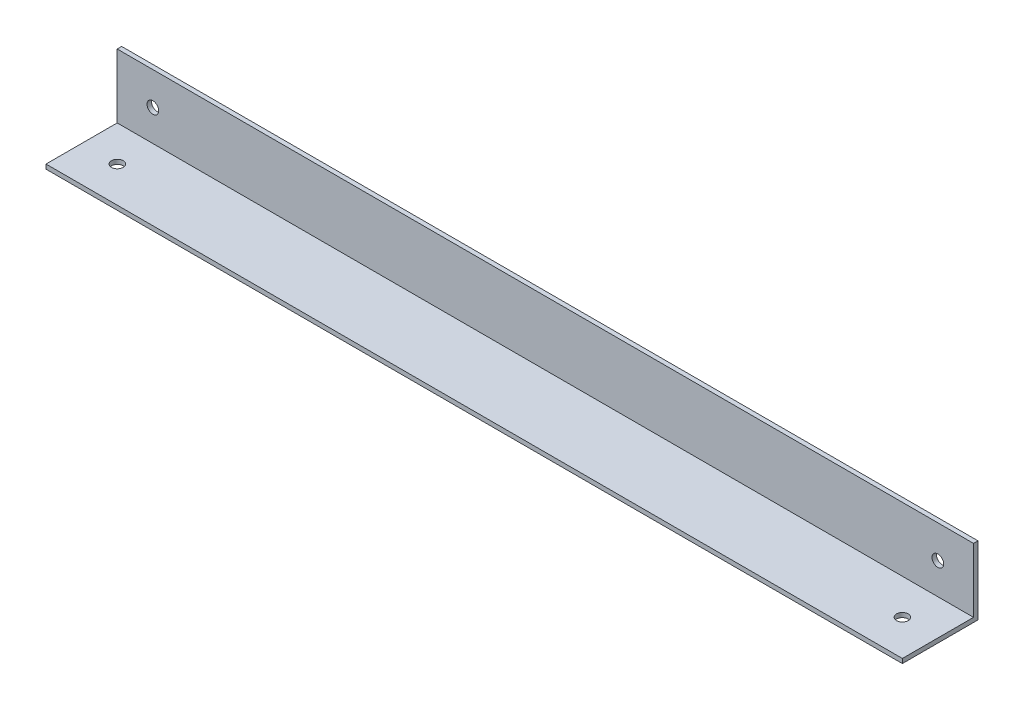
ISO-10303-21;
HEADER;
FILE_DESCRIPTION(('STEP AP214'),'2;1');
FILE_NAME('part.step','',(''),(''),'','','');
FILE_SCHEMA(('AUTOMOTIVE_DESIGN { 1 0 10303 214 1 1 1 1 }'));
ENDSEC;
DATA;
#1=APPLICATION_CONTEXT('core data for automotive mechanical design processes');
#2=APPLICATION_PROTOCOL_DEFINITION('international standard','automotive_design',2000,#1);
#3=PRODUCT_CONTEXT('',#1,'mechanical');
#4=PRODUCT('Part','Part','',(#3));
#5=PRODUCT_RELATED_PRODUCT_CATEGORY('part','',(#4));
#6=PRODUCT_DEFINITION_FORMATION('','',#4);
#7=PRODUCT_DEFINITION_CONTEXT('part definition',#1,'design');
#8=PRODUCT_DEFINITION('design','',#6,#7);
#9=PRODUCT_DEFINITION_SHAPE('','',#8);
#10=(LENGTH_UNIT() NAMED_UNIT(*) SI_UNIT(.MILLI.,.METRE.));
#11=(NAMED_UNIT(*) PLANE_ANGLE_UNIT() SI_UNIT($,.RADIAN.));
#12=(NAMED_UNIT(*) SI_UNIT($,.STERADIAN.) SOLID_ANGLE_UNIT());
#13=UNCERTAINTY_MEASURE_WITH_UNIT(LENGTH_MEASURE(1.E-05),#10,'distance_accuracy_value','');
#14=(GEOMETRIC_REPRESENTATION_CONTEXT(3) GLOBAL_UNCERTAINTY_ASSIGNED_CONTEXT((#13)) GLOBAL_UNIT_ASSIGNED_CONTEXT((#10,
#11,#12)) REPRESENTATION_CONTEXT('',''));
#15=CARTESIAN_POINT('',(0.,0.,0.));
#16=DIRECTION('',(0.,0.,1.));
#17=DIRECTION('',(1.,0.,0.));
#18=AXIS2_PLACEMENT_3D('',#15,#16,#17);
#19=CARTESIAN_POINT('',(0.,0.,26.924));
#20=DIRECTION('',(0.,0.,1.));
#21=DIRECTION('',(1.,0.,0.));
#22=AXIS2_PLACEMENT_3D('',#19,#20,#21);
#23=PLANE('',#22);
#24=DIRECTION('',(1.,0.,0.));
#25=VECTOR('',#24,1.);
#26=CARTESIAN_POINT('',(-209.826086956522,45.0420093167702,26.924));
#27=LINE('',#26,#25);
#28=CARTESIAN_POINT('',(-209.826086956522,45.0420093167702,26.924));
#29=VERTEX_POINT('',#28);
#30=CARTESIAN_POINT('',(94.9739130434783,45.0420093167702,26.924));
#31=VERTEX_POINT('',#30);
#32=EDGE_CURVE('E117',#29,#31,#27,.T.);
#33=ORIENTED_EDGE('',*,*,#32,.F.);
#34=DIRECTION('',(0.,-1.,0.));
#35=VECTOR('',#34,1.);
#36=CARTESIAN_POINT('',(-209.826086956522,67.8385093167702,26.924));
#37=LINE('',#36,#35);
#38=CARTESIAN_POINT('',(-209.826086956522,43.4545093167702,26.924));
#39=VERTEX_POINT('',#38);
#40=EDGE_CURVE('E95',#29,#39,#37,.T.);
#41=ORIENTED_EDGE('',*,*,#40,.T.);
#42=DIRECTION('',(1.,0.,0.));
#43=VECTOR('',#42,1.);
#44=CARTESIAN_POINT('',(-209.826086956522,43.4545093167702,26.924));
#45=LINE('',#44,#43);
#46=CARTESIAN_POINT('',(94.9739130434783,43.4545093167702,26.924));
#47=VERTEX_POINT('',#46);
#48=EDGE_CURVE('E57',#39,#47,#45,.T.);
#49=ORIENTED_EDGE('',*,*,#48,.T.);
#50=DIRECTION('',(0.,1.,0.));
#51=VECTOR('',#50,1.);
#52=CARTESIAN_POINT('',(94.9739130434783,67.8385093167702,26.924));
#53=LINE('',#52,#51);
#54=EDGE_CURVE('E88',#47,#31,#53,.T.);
#55=ORIENTED_EDGE('',*,*,#54,.T.);
#56=EDGE_LOOP('',(#33,#41,#49,#55));
#57=FACE_BOUND('',#56,.T.);
#58=ADVANCED_FACE('F38',(#57),#23,.T.);
#59=CARTESIAN_POINT('',(-209.826086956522,67.8385093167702,26.924));
#60=DIRECTION('',(1.,0.,0.));
#61=DIRECTION('',(0.,0.,-1.));
#62=AXIS2_PLACEMENT_3D('',#59,#60,#61);
#63=PLANE('',#62);
#64=DIRECTION('',(0.,0.,1.));
#65=VECTOR('',#64,1.);
#66=CARTESIAN_POINT('',(-209.826086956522,45.0420093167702,-303.37967743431));
#67=LINE('',#66,#65);
#68=CARTESIAN_POINT('',(-209.826086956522,45.0420093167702,1.58750000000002));
#69=VERTEX_POINT('',#68);
#70=EDGE_CURVE('E145',#69,#29,#67,.T.);
#71=ORIENTED_EDGE('',*,*,#70,.F.);
#72=DIRECTION('',(0.,1.,0.));
#73=VECTOR('',#72,1.);
#74=CARTESIAN_POINT('',(-209.826086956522,55.1385093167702,1.5875));
#75=LINE('',#74,#73);
#76=CARTESIAN_POINT('',(-209.826086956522,67.8385093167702,1.5875));
#77=VERTEX_POINT('',#76);
#78=EDGE_CURVE('E87',#69,#77,#75,.T.);
#79=ORIENTED_EDGE('',*,*,#78,.T.);
#80=DIRECTION('',(0.,0.,-1.));
#81=VECTOR('',#80,1.);
#82=CARTESIAN_POINT('',(-209.826086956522,67.8385093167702,26.924));
#83=LINE('',#82,#81);
#84=CARTESIAN_POINT('',(-209.826086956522,67.8385093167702,0.));
#85=VERTEX_POINT('',#84);
#86=EDGE_CURVE('E81',#77,#85,#83,.T.);
#87=ORIENTED_EDGE('',*,*,#86,.T.);
#88=DIRECTION('',(0.,-1.,0.));
#89=VECTOR('',#88,1.);
#90=CARTESIAN_POINT('',(-209.826086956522,67.8385093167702,0.));
#91=LINE('',#90,#89);
#92=CARTESIAN_POINT('',(-209.826086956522,43.4545093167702,0.));
#93=VERTEX_POINT('',#92);
#94=EDGE_CURVE('E85',#85,#93,#91,.T.);
#95=ORIENTED_EDGE('',*,*,#94,.T.);
#96=DIRECTION('',(0.,0.,-1.));
#97=VECTOR('',#96,1.);
#98=CARTESIAN_POINT('',(-209.826086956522,43.4545093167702,26.924));
#99=LINE('',#98,#97);
#100=EDGE_CURVE('E11',#39,#93,#99,.T.);
#101=ORIENTED_EDGE('',*,*,#100,.F.);
#102=ORIENTED_EDGE('',*,*,#40,.F.);
#103=EDGE_LOOP('',(#71,#79,#87,#95,#101,#102));
#104=FACE_BOUND('',#103,.T.);
#105=ADVANCED_FACE('F40',(#104),#63,.F.);
#106=CARTESIAN_POINT('',(-209.826086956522,43.4545093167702,26.924));
#107=DIRECTION('',(0.,1.,0.));
#108=DIRECTION('',(0.,0.,1.));
#109=AXIS2_PLACEMENT_3D('',#106,#107,#108);
#110=PLANE('',#109);
#111=CARTESIAN_POINT('',(-197.126086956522,43.4545093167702,14.224));
#112=DIRECTION('',(0.,-1.,0.));
#113=DIRECTION('',(0.,0.,-1.));
#114=AXIS2_PLACEMENT_3D('',#111,#112,#113);
#115=CIRCLE('',#114,2.08279999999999);
#116=CARTESIAN_POINT('',(-197.126086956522,43.4545093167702,12.1412));
#117=VERTEX_POINT('',#116);
#118=EDGE_CURVE('E120',#117,#117,#115,.T.);
#119=ORIENTED_EDGE('',*,*,#118,.F.);
#120=EDGE_LOOP('',(#119));
#121=FACE_BOUND('',#120,.T.);
#122=CARTESIAN_POINT('',(82.2739130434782,43.4545093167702,14.224));
#123=DIRECTION('',(0.,-1.,0.));
#124=DIRECTION('',(0.,0.,1.));
#125=AXIS2_PLACEMENT_3D('',#122,#123,#124);
#126=CIRCLE('',#125,2.0828);
#127=CARTESIAN_POINT('',(82.2739130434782,43.4545093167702,16.3068));
#128=VERTEX_POINT('',#127);
#129=EDGE_CURVE('E126',#128,#128,#126,.T.);
#130=ORIENTED_EDGE('',*,*,#129,.F.);
#131=EDGE_LOOP('',(#130));
#132=FACE_BOUND('',#131,.T.);
#133=DIRECTION('',(1.,0.,0.));
#134=VECTOR('',#133,1.);
#135=CARTESIAN_POINT('',(-209.826086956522,43.4545093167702,0.));
#136=LINE('',#135,#134);
#137=CARTESIAN_POINT('',(94.9739130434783,43.4545093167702,0.));
#138=VERTEX_POINT('',#137);
#139=EDGE_CURVE('E99',#93,#138,#136,.T.);
#140=ORIENTED_EDGE('',*,*,#139,.T.);
#141=DIRECTION('',(0.,0.,-1.));
#142=VECTOR('',#141,1.);
#143=CARTESIAN_POINT('',(94.9739130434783,43.4545093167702,26.924));
#144=LINE('',#143,#142);
#145=EDGE_CURVE('E48',#47,#138,#144,.T.);
#146=ORIENTED_EDGE('',*,*,#145,.F.);
#147=ORIENTED_EDGE('',*,*,#48,.F.);
#148=ORIENTED_EDGE('',*,*,#100,.T.);
#149=EDGE_LOOP('',(#140,#146,#147,#148));
#150=FACE_BOUND('',#149,.T.);
#151=ADVANCED_FACE('F176',(#121,#132,#150),#110,.F.);
#152=CARTESIAN_POINT('',(94.9739130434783,67.8385093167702,26.924));
#153=DIRECTION('',(-1.,0.,0.));
#154=DIRECTION('',(0.,0.,1.));
#155=AXIS2_PLACEMENT_3D('',#152,#153,#154);
#156=PLANE('',#155);
#157=DIRECTION('',(0.,1.,0.));
#158=VECTOR('',#157,1.);
#159=CARTESIAN_POINT('',(94.9739130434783,55.1385093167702,1.5875));
#160=LINE('',#159,#158);
#161=CARTESIAN_POINT('',(94.9739130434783,45.0420093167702,1.58750000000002));
#162=VERTEX_POINT('',#161);
#163=CARTESIAN_POINT('',(94.9739130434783,67.8385093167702,1.5875));
#164=VERTEX_POINT('',#163);
#165=EDGE_CURVE('E102',#162,#164,#160,.T.);
#166=ORIENTED_EDGE('',*,*,#165,.F.);
#167=DIRECTION('',(0.,0.,1.));
#168=VECTOR('',#167,1.);
#169=CARTESIAN_POINT('',(94.9739130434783,45.0420093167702,-303.37967743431));
#170=LINE('',#169,#168);
#171=EDGE_CURVE('E142',#162,#31,#170,.T.);
#172=ORIENTED_EDGE('',*,*,#171,.T.);
#173=ORIENTED_EDGE('',*,*,#54,.F.);
#174=ORIENTED_EDGE('',*,*,#145,.T.);
#175=DIRECTION('',(0.,1.,0.));
#176=VECTOR('',#175,1.);
#177=CARTESIAN_POINT('',(94.9739130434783,67.8385093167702,0.));
#178=LINE('',#177,#176);
#179=CARTESIAN_POINT('',(94.9739130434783,67.8385093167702,0.));
#180=VERTEX_POINT('',#179);
#181=EDGE_CURVE('E96',#138,#180,#178,.T.);
#182=ORIENTED_EDGE('',*,*,#181,.T.);
#183=DIRECTION('',(0.,0.,-1.));
#184=VECTOR('',#183,1.);
#185=CARTESIAN_POINT('',(94.9739130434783,67.8385093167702,26.924));
#186=LINE('',#185,#184);
#187=EDGE_CURVE('E74',#164,#180,#186,.T.);
#188=ORIENTED_EDGE('',*,*,#187,.F.);
#189=EDGE_LOOP('',(#166,#172,#173,#174,#182,#188));
#190=FACE_BOUND('',#189,.T.);
#191=ADVANCED_FACE('F162',(#190),#156,.F.);
#192=CARTESIAN_POINT('',(-209.826086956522,67.8385093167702,26.924));
#193=DIRECTION('',(0.,-1.,0.));
#194=DIRECTION('',(0.,0.,-1.));
#195=AXIS2_PLACEMENT_3D('',#192,#193,#194);
#196=PLANE('',#195);
#197=ORIENTED_EDGE('',*,*,#86,.F.);
#198=DIRECTION('',(-1.,0.,0.));
#199=VECTOR('',#198,1.);
#200=CARTESIAN_POINT('',(-209.826086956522,67.8385093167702,1.5875));
#201=LINE('',#200,#199);
#202=EDGE_CURVE('E148',#164,#77,#201,.T.);
#203=ORIENTED_EDGE('',*,*,#202,.F.);
#204=ORIENTED_EDGE('',*,*,#187,.T.);
#205=DIRECTION('',(-1.,0.,0.));
#206=VECTOR('',#205,1.);
#207=CARTESIAN_POINT('',(-209.826086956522,67.8385093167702,0.));
#208=LINE('',#207,#206);
#209=EDGE_CURVE('E91',#180,#85,#208,.T.);
#210=ORIENTED_EDGE('',*,*,#209,.T.);
#211=EDGE_LOOP('',(#197,#203,#204,#210));
#212=FACE_BOUND('',#211,.T.);
#213=ADVANCED_FACE('F92',(#212),#196,.F.);
#214=CARTESIAN_POINT('',(0.,0.,0.));
#215=DIRECTION('',(0.,0.,1.));
#216=DIRECTION('',(1.,0.,0.));
#217=AXIS2_PLACEMENT_3D('',#214,#215,#216);
#218=PLANE('',#217);
#219=CARTESIAN_POINT('',(82.2739130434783,56.1545093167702,0.));
#220=DIRECTION('',(0.,0.,-1.));
#221=DIRECTION('',(-1.,0.,0.));
#222=AXIS2_PLACEMENT_3D('',#219,#220,#221);
#223=CIRCLE('',#222,2.0828);
#224=CARTESIAN_POINT('',(80.1911130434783,56.1545093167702,0.));
#225=VERTEX_POINT('',#224);
#226=EDGE_CURVE('E115',#225,#225,#223,.T.);
#227=ORIENTED_EDGE('',*,*,#226,.F.);
#228=EDGE_LOOP('',(#227));
#229=FACE_BOUND('',#228,.T.);
#230=CARTESIAN_POINT('',(-197.126086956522,56.1545093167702,0.));
#231=DIRECTION('',(0.,0.,-1.));
#232=DIRECTION('',(1.,0.,0.));
#233=AXIS2_PLACEMENT_3D('',#230,#231,#232);
#234=CIRCLE('',#233,2.08279999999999);
#235=CARTESIAN_POINT('',(-195.043286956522,56.1545093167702,0.));
#236=VERTEX_POINT('',#235);
#237=EDGE_CURVE('E124',#236,#236,#234,.T.);
#238=ORIENTED_EDGE('',*,*,#237,.F.);
#239=EDGE_LOOP('',(#238));
#240=FACE_BOUND('',#239,.T.);
#241=ORIENTED_EDGE('',*,*,#94,.F.);
#242=ORIENTED_EDGE('',*,*,#209,.F.);
#243=ORIENTED_EDGE('',*,*,#181,.F.);
#244=ORIENTED_EDGE('',*,*,#139,.F.);
#245=EDGE_LOOP('',(#241,#242,#243,#244));
#246=FACE_BOUND('',#245,.T.);
#247=ADVANCED_FACE('F98',(#229,#240,#246),#218,.F.);
#248=CARTESIAN_POINT('',(-209.826086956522,55.1385093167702,1.5875));
#249=DIRECTION('',(0.,0.,-1.));
#250=DIRECTION('',(-1.,0.,0.));
#251=AXIS2_PLACEMENT_3D('',#248,#249,#250);
#252=PLANE('',#251);
#253=CARTESIAN_POINT('',(82.2739130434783,56.1545093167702,1.5875));
#254=DIRECTION('',(0.,0.,-1.));
#255=DIRECTION('',(-1.,0.,0.));
#256=AXIS2_PLACEMENT_3D('',#253,#254,#255);
#257=CIRCLE('',#256,2.0828);
#258=CARTESIAN_POINT('',(80.1911130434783,56.1545093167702,1.5875));
#259=VERTEX_POINT('',#258);
#260=EDGE_CURVE('E114',#259,#259,#257,.T.);
#261=ORIENTED_EDGE('',*,*,#260,.T.);
#262=EDGE_LOOP('',(#261));
#263=FACE_BOUND('',#262,.T.);
#264=CARTESIAN_POINT('',(-197.126086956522,56.1545093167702,1.5875));
#265=DIRECTION('',(0.,0.,-1.));
#266=DIRECTION('',(-1.,0.,0.));
#267=AXIS2_PLACEMENT_3D('',#264,#265,#266);
#268=CIRCLE('',#267,2.08279999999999);
#269=CARTESIAN_POINT('',(-199.208886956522,56.1545093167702,1.5875));
#270=VERTEX_POINT('',#269);
#271=EDGE_CURVE('E111',#270,#270,#268,.T.);
#272=ORIENTED_EDGE('',*,*,#271,.T.);
#273=EDGE_LOOP('',(#272));
#274=FACE_BOUND('',#273,.T.);
#275=ORIENTED_EDGE('',*,*,#202,.T.);
#276=ORIENTED_EDGE('',*,*,#78,.F.);
#277=DIRECTION('',(1.,0.,0.));
#278=VECTOR('',#277,1.);
#279=CARTESIAN_POINT('',(-209.826086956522,45.0420093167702,1.58750000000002));
#280=LINE('',#279,#278);
#281=EDGE_CURVE('E139',#69,#162,#280,.T.);
#282=ORIENTED_EDGE('',*,*,#281,.T.);
#283=ORIENTED_EDGE('',*,*,#165,.T.);
#284=EDGE_LOOP('',(#275,#276,#282,#283));
#285=FACE_BOUND('',#284,.T.);
#286=ADVANCED_FACE('F170',(#263,#274,#285),#252,.F.);
#287=CARTESIAN_POINT('',(-209.826086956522,45.0420093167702,-303.37967743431));
#288=DIRECTION('',(0.,-1.,0.));
#289=DIRECTION('',(0.,0.,-1.));
#290=AXIS2_PLACEMENT_3D('',#287,#288,#289);
#291=PLANE('',#290);
#292=CARTESIAN_POINT('',(-197.126086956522,45.0420093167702,14.224));
#293=DIRECTION('',(0.,-1.,0.));
#294=DIRECTION('',(0.,0.,-1.));
#295=AXIS2_PLACEMENT_3D('',#292,#293,#294);
#296=CIRCLE('',#295,2.08279999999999);
#297=CARTESIAN_POINT('',(-197.126086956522,45.0420093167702,12.1412));
#298=VERTEX_POINT('',#297);
#299=EDGE_CURVE('E42',#298,#298,#296,.T.);
#300=ORIENTED_EDGE('',*,*,#299,.T.);
#301=EDGE_LOOP('',(#300));
#302=FACE_BOUND('',#301,.T.);
#303=CARTESIAN_POINT('',(82.2739130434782,45.0420093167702,14.224));
#304=DIRECTION('',(0.,-1.,0.));
#305=DIRECTION('',(0.,0.,-1.));
#306=AXIS2_PLACEMENT_3D('',#303,#304,#305);
#307=CIRCLE('',#306,2.0828);
#308=CARTESIAN_POINT('',(82.2739130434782,45.0420093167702,12.1412));
#309=VERTEX_POINT('',#308);
#310=EDGE_CURVE('E118',#309,#309,#307,.T.);
#311=ORIENTED_EDGE('',*,*,#310,.T.);
#312=EDGE_LOOP('',(#311));
#313=FACE_BOUND('',#312,.T.);
#314=ORIENTED_EDGE('',*,*,#70,.T.);
#315=ORIENTED_EDGE('',*,*,#32,.T.);
#316=ORIENTED_EDGE('',*,*,#171,.F.);
#317=ORIENTED_EDGE('',*,*,#281,.F.);
#318=EDGE_LOOP('',(#314,#315,#316,#317));
#319=FACE_BOUND('',#318,.T.);
#320=ADVANCED_FACE('F167',(#302,#313,#319),#291,.F.);
#321=CARTESIAN_POINT('',(-197.126086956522,56.1545093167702,2.54));
#322=DIRECTION('',(0.,0.,-1.));
#323=DIRECTION('',(-1.,0.,0.));
#324=AXIS2_PLACEMENT_3D('',#321,#322,#323);
#325=CYLINDRICAL_SURFACE('',#324,2.08279999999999);
#326=ORIENTED_EDGE('',*,*,#237,.T.);
#327=EDGE_LOOP('',(#326));
#328=FACE_BOUND('',#327,.T.);
#329=ORIENTED_EDGE('',*,*,#271,.F.);
#330=EDGE_LOOP('',(#329));
#331=FACE_BOUND('',#330,.T.);
#332=ADVANCED_FACE('F226',(#328,#331),#325,.F.);
#333=CARTESIAN_POINT('',(82.2739130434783,56.1545093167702,2.54));
#334=DIRECTION('',(0.,0.,-1.));
#335=DIRECTION('',(-1.,0.,0.));
#336=AXIS2_PLACEMENT_3D('',#333,#334,#335);
#337=CYLINDRICAL_SURFACE('',#336,2.0828);
#338=ORIENTED_EDGE('',*,*,#226,.T.);
#339=EDGE_LOOP('',(#338));
#340=FACE_BOUND('',#339,.T.);
#341=ORIENTED_EDGE('',*,*,#260,.F.);
#342=EDGE_LOOP('',(#341));
#343=FACE_BOUND('',#342,.T.);
#344=ADVANCED_FACE('F236',(#340,#343),#337,.F.);
#345=CARTESIAN_POINT('',(82.2739130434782,45.9945093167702,14.224));
#346=DIRECTION('',(0.,-1.,0.));
#347=DIRECTION('',(0.,0.,-1.));
#348=AXIS2_PLACEMENT_3D('',#345,#346,#347);
#349=CYLINDRICAL_SURFACE('',#348,2.0828);
#350=ORIENTED_EDGE('',*,*,#129,.T.);
#351=EDGE_LOOP('',(#350));
#352=FACE_BOUND('',#351,.T.);
#353=ORIENTED_EDGE('',*,*,#310,.F.);
#354=EDGE_LOOP('',(#353));
#355=FACE_BOUND('',#354,.T.);
#356=ADVANCED_FACE('F242',(#352,#355),#349,.F.);
#357=CARTESIAN_POINT('',(-197.126086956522,45.9945093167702,14.224));
#358=DIRECTION('',(0.,-1.,0.));
#359=DIRECTION('',(0.,0.,-1.));
#360=AXIS2_PLACEMENT_3D('',#357,#358,#359);
#361=CYLINDRICAL_SURFACE('',#360,2.08279999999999);
#362=ORIENTED_EDGE('',*,*,#118,.T.);
#363=EDGE_LOOP('',(#362));
#364=FACE_BOUND('',#363,.T.);
#365=ORIENTED_EDGE('',*,*,#299,.F.);
#366=EDGE_LOOP('',(#365));
#367=FACE_BOUND('',#366,.T.);
#368=ADVANCED_FACE('F249',(#364,#367),#361,.F.);
#369=CLOSED_SHELL('',(#58,#105,#151,#191,#213,#247,#286,#320,#332,#344,#356,#368));
#370=MANIFOLD_SOLID_BREP('B2',#369);
#371=ADVANCED_BREP_SHAPE_REPRESENTATION('',(#18,#370),#14);
#372=SHAPE_DEFINITION_REPRESENTATION(#9,#371);
ENDSEC;
END-ISO-10303-21;
